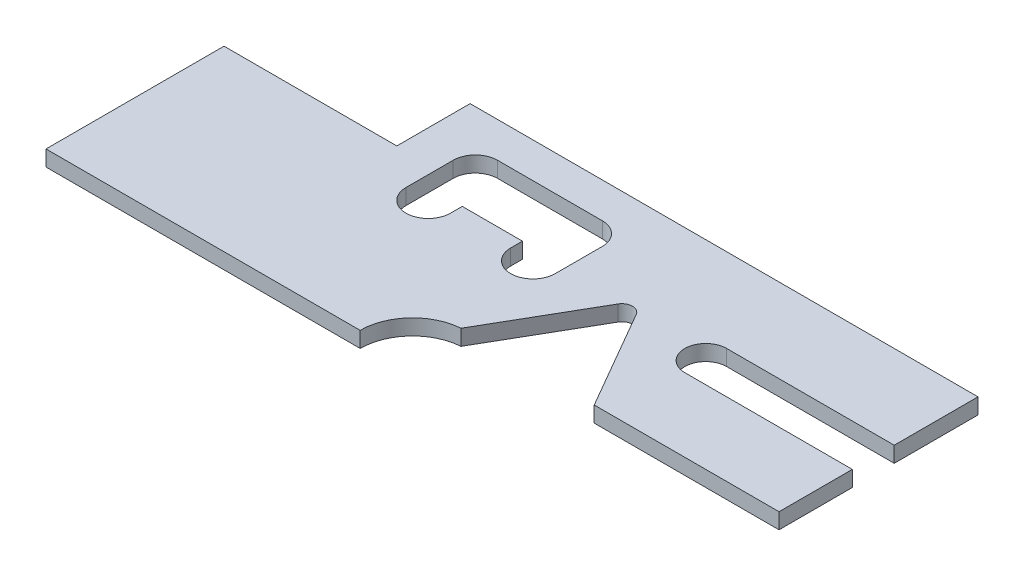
ISO-10303-21;
HEADER;
FILE_DESCRIPTION(('STEP AP214'),'2;1');
FILE_NAME('part.step','',(''),(''),'','','');
FILE_SCHEMA(('AUTOMOTIVE_DESIGN { 1 0 10303 214 1 1 1 1 }'));
ENDSEC;
DATA;
#1=APPLICATION_CONTEXT('core data for automotive mechanical design processes');
#2=APPLICATION_PROTOCOL_DEFINITION('international standard','automotive_design',2000,#1);
#3=PRODUCT_CONTEXT('',#1,'mechanical');
#4=PRODUCT('Part','Part','',(#3));
#5=PRODUCT_RELATED_PRODUCT_CATEGORY('part','',(#4));
#6=PRODUCT_DEFINITION_FORMATION('','',#4);
#7=PRODUCT_DEFINITION_CONTEXT('part definition',#1,'design');
#8=PRODUCT_DEFINITION('design','',#6,#7);
#9=PRODUCT_DEFINITION_SHAPE('','',#8);
#10=(LENGTH_UNIT() NAMED_UNIT(*) SI_UNIT(.MILLI.,.METRE.));
#11=(NAMED_UNIT(*) PLANE_ANGLE_UNIT() SI_UNIT($,.RADIAN.));
#12=(NAMED_UNIT(*) SI_UNIT($,.STERADIAN.) SOLID_ANGLE_UNIT());
#13=UNCERTAINTY_MEASURE_WITH_UNIT(LENGTH_MEASURE(1.E-05),#10,'distance_accuracy_value','');
#14=(GEOMETRIC_REPRESENTATION_CONTEXT(3) GLOBAL_UNCERTAINTY_ASSIGNED_CONTEXT((#13)) GLOBAL_UNIT_ASSIGNED_CONTEXT((#10,
#11,#12)) REPRESENTATION_CONTEXT('',''));
#15=CARTESIAN_POINT('',(0.,0.,0.));
#16=DIRECTION('',(0.,0.,1.));
#17=DIRECTION('',(1.,0.,0.));
#18=AXIS2_PLACEMENT_3D('',#15,#16,#17);
#19=CARTESIAN_POINT('',(98.,3.,-28.));
#20=DIRECTION('',(0.,1.,0.));
#21=DIRECTION('',(0.,0.,1.));
#22=AXIS2_PLACEMENT_3D('',#19,#20,#21);
#23=PLANE('',#22);
#24=DIRECTION('',(0.,0.,1.));
#25=VECTOR('',#24,1.);
#26=CARTESIAN_POINT('',(0.,3.,0.));
#27=LINE('',#26,#25);
#28=CARTESIAN_POINT('',(0.,3.,-34.));
#29=VERTEX_POINT('',#28);
#30=CARTESIAN_POINT('',(0.,3.,0.));
#31=VERTEX_POINT('',#30);
#32=EDGE_CURVE('E277',#29,#31,#27,.T.);
#33=ORIENTED_EDGE('',*,*,#32,.T.);
#34=DIRECTION('',(1.,0.,0.));
#35=VECTOR('',#34,1.);
#36=CARTESIAN_POINT('',(0.,3.,0.));
#37=LINE('',#36,#35);
#38=CARTESIAN_POINT('',(60.,3.,0.));
#39=VERTEX_POINT('',#38);
#40=EDGE_CURVE('E280',#31,#39,#37,.T.);
#41=ORIENTED_EDGE('',*,*,#40,.T.);
#42=CARTESIAN_POINT('',(70.,3.,0.));
#43=DIRECTION('',(0.,-1.,0.));
#44=DIRECTION('',(0.,0.,1.));
#45=AXIS2_PLACEMENT_3D('',#42,#43,#44);
#46=CIRCLE('',#45,10.);
#47=CARTESIAN_POINT('',(69.2834532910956,3.,-9.97429500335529));
#48=VERTEX_POINT('',#47);
#49=EDGE_CURVE('E283',#39,#48,#46,.T.);
#50=ORIENTED_EDGE('',*,*,#49,.T.);
#51=DIRECTION('',(0.500000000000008,0.,-0.866025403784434));
#52=VECTOR('',#51,1.);
#53=CARTESIAN_POINT('',(69.2834532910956,3.,-9.97429500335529));
#54=LINE('',#53,#52);
#55=CARTESIAN_POINT('',(80.2679491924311,3.,-29.));
#56=VERTEX_POINT('',#55);
#57=EDGE_CURVE('E285',#48,#56,#54,.T.);
#58=ORIENTED_EDGE('',*,*,#57,.T.);
#59=CARTESIAN_POINT('',(82.,3.,-28.));
#60=DIRECTION('',(0.,-1.,0.));
#61=DIRECTION('',(0.,0.,1.));
#62=AXIS2_PLACEMENT_3D('',#59,#60,#61);
#63=CIRCLE('',#62,2.);
#64=CARTESIAN_POINT('',(83.7320508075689,3.,-29.));
#65=VERTEX_POINT('',#64);
#66=EDGE_CURVE('E287',#56,#65,#63,.T.);
#67=ORIENTED_EDGE('',*,*,#66,.T.);
#68=DIRECTION('',(0.499999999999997,0.,0.866025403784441));
#69=VECTOR('',#68,1.);
#70=CARTESIAN_POINT('',(94.7017059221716,3.,-10.));
#71=LINE('',#70,#69);
#72=CARTESIAN_POINT('',(94.7017059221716,3.,-10.));
#73=VERTEX_POINT('',#72);
#74=EDGE_CURVE('E289',#65,#73,#71,.T.);
#75=ORIENTED_EDGE('',*,*,#74,.T.);
#76=DIRECTION('',(1.,0.,0.));
#77=VECTOR('',#76,1.);
#78=CARTESIAN_POINT('',(130.,3.,-10.));
#79=LINE('',#78,#77);
#80=CARTESIAN_POINT('',(130.,3.,-10.));
#81=VERTEX_POINT('',#80);
#82=EDGE_CURVE('E291',#73,#81,#79,.T.);
#83=ORIENTED_EDGE('',*,*,#82,.T.);
#84=DIRECTION('',(0.,0.,-1.));
#85=VECTOR('',#84,1.);
#86=CARTESIAN_POINT('',(130.,3.,-10.));
#87=LINE('',#86,#85);
#88=CARTESIAN_POINT('',(130.,3.,-24.));
#89=VERTEX_POINT('',#88);
#90=EDGE_CURVE('E293',#81,#89,#87,.T.);
#91=ORIENTED_EDGE('',*,*,#90,.T.);
#92=DIRECTION('',(-1.,0.,0.));
#93=VECTOR('',#92,1.);
#94=CARTESIAN_POINT('',(98.,3.,-24.));
#95=LINE('',#94,#93);
#96=CARTESIAN_POINT('',(98.,3.,-24.));
#97=VERTEX_POINT('',#96);
#98=EDGE_CURVE('E295',#89,#97,#95,.T.);
#99=ORIENTED_EDGE('',*,*,#98,.T.);
#100=CARTESIAN_POINT('',(98.,3.,-28.));
#101=DIRECTION('',(0.,-1.,0.));
#102=DIRECTION('',(0.,0.,1.));
#103=AXIS2_PLACEMENT_3D('',#100,#101,#102);
#104=CIRCLE('',#103,3.99999999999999);
#105=CARTESIAN_POINT('',(98.,3.,-32.));
#106=VERTEX_POINT('',#105);
#107=EDGE_CURVE('E297',#97,#106,#104,.T.);
#108=ORIENTED_EDGE('',*,*,#107,.T.);
#109=DIRECTION('',(1.,0.,0.));
#110=VECTOR('',#109,1.);
#111=CARTESIAN_POINT('',(98.,3.,-32.));
#112=LINE('',#111,#110);
#113=CARTESIAN_POINT('',(130.,3.,-32.));
#114=VERTEX_POINT('',#113);
#115=EDGE_CURVE('E299',#106,#114,#112,.T.);
#116=ORIENTED_EDGE('',*,*,#115,.T.);
#117=DIRECTION('',(0.,0.,-1.));
#118=VECTOR('',#117,1.);
#119=CARTESIAN_POINT('',(130.,3.,-32.));
#120=LINE('',#119,#118);
#121=CARTESIAN_POINT('',(130.,3.,-48.));
#122=VERTEX_POINT('',#121);
#123=EDGE_CURVE('E301',#114,#122,#120,.T.);
#124=ORIENTED_EDGE('',*,*,#123,.T.);
#125=DIRECTION('',(-1.,0.,0.));
#126=VECTOR('',#125,1.);
#127=CARTESIAN_POINT('',(33.,3.,-48.));
#128=LINE('',#127,#126);
#129=CARTESIAN_POINT('',(33.,3.,-48.));
#130=VERTEX_POINT('',#129);
#131=EDGE_CURVE('E303',#122,#130,#128,.T.);
#132=ORIENTED_EDGE('',*,*,#131,.T.);
#133=DIRECTION('',(0.,0.,1.));
#134=VECTOR('',#133,1.);
#135=CARTESIAN_POINT('',(33.,3.,-48.));
#136=LINE('',#135,#134);
#137=CARTESIAN_POINT('',(33.,3.,-34.));
#138=VERTEX_POINT('',#137);
#139=EDGE_CURVE('E305',#130,#138,#136,.T.);
#140=ORIENTED_EDGE('',*,*,#139,.T.);
#141=DIRECTION('',(-1.,0.,0.));
#142=VECTOR('',#141,1.);
#143=CARTESIAN_POINT('',(33.,3.,-34.));
#144=LINE('',#143,#142);
#145=EDGE_CURVE('E307',#138,#29,#144,.T.);
#146=ORIENTED_EDGE('',*,*,#145,.T.);
#147=EDGE_LOOP('',(#33,#41,#50,#58,#67,#75,#83,#91,#99,#108,#116,#124,#132,#140,#146));
#148=FACE_BOUND('',#147,.T.);
#149=DIRECTION('',(0.,0.,-1.));
#150=VECTOR('',#149,1.);
#151=CARTESIAN_POINT('',(69.25,3.,-28.));
#152=LINE('',#151,#150);
#153=CARTESIAN_POINT('',(69.25,3.,-28.));
#154=VERTEX_POINT('',#153);
#155=CARTESIAN_POINT('',(69.25,3.,-37.));
#156=VERTEX_POINT('',#155);
#157=EDGE_CURVE('E206',#154,#156,#152,.T.);
#158=ORIENTED_EDGE('',*,*,#157,.F.);
#159=CARTESIAN_POINT('',(65.,3.,-28.));
#160=DIRECTION('',(0.,1.,0.));
#161=DIRECTION('',(0.,0.,1.));
#162=AXIS2_PLACEMENT_3D('',#159,#160,#161);
#163=CIRCLE('',#162,4.24999999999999);
#164=CARTESIAN_POINT('',(60.75,3.,-28.));
#165=VERTEX_POINT('',#164);
#166=EDGE_CURVE('E198',#165,#154,#163,.T.);
#167=ORIENTED_EDGE('',*,*,#166,.F.);
#168=DIRECTION('',(0.,0.,1.));
#169=VECTOR('',#168,1.);
#170=CARTESIAN_POINT('',(60.75,3.,-28.));
#171=LINE('',#170,#169);
#172=CARTESIAN_POINT('',(60.75,3.,-30.25));
#173=VERTEX_POINT('',#172);
#174=EDGE_CURVE('E235',#173,#165,#171,.T.);
#175=ORIENTED_EDGE('',*,*,#174,.F.);
#176=DIRECTION('',(1.,0.,0.));
#177=VECTOR('',#176,1.);
#178=CARTESIAN_POINT('',(49.25,3.,-30.25));
#179=LINE('',#178,#177);
#180=CARTESIAN_POINT('',(49.25,3.,-30.25));
#181=VERTEX_POINT('',#180);
#182=EDGE_CURVE('E233',#181,#173,#179,.T.);
#183=ORIENTED_EDGE('',*,*,#182,.F.);
#184=DIRECTION('',(0.,0.,-1.));
#185=VECTOR('',#184,1.);
#186=CARTESIAN_POINT('',(49.25,3.,-28.));
#187=LINE('',#186,#185);
#188=CARTESIAN_POINT('',(49.25,3.,-28.));
#189=VERTEX_POINT('',#188);
#190=EDGE_CURVE('E231',#189,#181,#187,.T.);
#191=ORIENTED_EDGE('',*,*,#190,.F.);
#192=CARTESIAN_POINT('',(45.,3.,-28.));
#193=DIRECTION('',(0.,1.,0.));
#194=DIRECTION('',(0.,0.,1.));
#195=AXIS2_PLACEMENT_3D('',#192,#193,#194);
#196=CIRCLE('',#195,4.25);
#197=CARTESIAN_POINT('',(40.75,3.,-28.));
#198=VERTEX_POINT('',#197);
#199=EDGE_CURVE('E229',#198,#189,#196,.T.);
#200=ORIENTED_EDGE('',*,*,#199,.F.);
#201=DIRECTION('',(0.,0.,1.));
#202=VECTOR('',#201,1.);
#203=CARTESIAN_POINT('',(40.75,3.,-37.));
#204=LINE('',#203,#202);
#205=CARTESIAN_POINT('',(40.75,3.,-37.));
#206=VERTEX_POINT('',#205);
#207=EDGE_CURVE('E227',#206,#198,#204,.T.);
#208=ORIENTED_EDGE('',*,*,#207,.F.);
#209=CARTESIAN_POINT('',(45.,3.,-37.));
#210=DIRECTION('',(0.,1.,0.));
#211=DIRECTION('',(0.,0.,-1.));
#212=AXIS2_PLACEMENT_3D('',#209,#210,#211);
#213=CIRCLE('',#212,4.25);
#214=CARTESIAN_POINT('',(45.,3.,-41.25));
#215=VERTEX_POINT('',#214);
#216=EDGE_CURVE('E225',#215,#206,#213,.T.);
#217=ORIENTED_EDGE('',*,*,#216,.F.);
#218=DIRECTION('',(-1.,0.,0.));
#219=VECTOR('',#218,1.);
#220=CARTESIAN_POINT('',(65.,3.,-41.25));
#221=LINE('',#220,#219);
#222=CARTESIAN_POINT('',(65.,3.,-41.25));
#223=VERTEX_POINT('',#222);
#224=EDGE_CURVE('E221',#223,#215,#221,.T.);
#225=ORIENTED_EDGE('',*,*,#224,.F.);
#226=CARTESIAN_POINT('',(65.,3.,-37.));
#227=DIRECTION('',(0.,1.,0.));
#228=DIRECTION('',(0.,0.,1.));
#229=AXIS2_PLACEMENT_3D('',#226,#227,#228);
#230=CIRCLE('',#229,4.25000000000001);
#231=EDGE_CURVE('E219',#156,#223,#230,.T.);
#232=ORIENTED_EDGE('',*,*,#231,.F.);
#233=EDGE_LOOP('',(#158,#167,#175,#183,#191,#200,#208,#217,#225,#232));
#234=FACE_BOUND('',#233,.T.);
#235=ADVANCED_FACE('F31',(#148,#234),#23,.T.);
#236=CARTESIAN_POINT('',(98.,0.,-28.));
#237=DIRECTION('',(0.,1.,0.));
#238=DIRECTION('',(0.,0.,1.));
#239=AXIS2_PLACEMENT_3D('',#236,#237,#238);
#240=PLANE('',#239);
#241=DIRECTION('',(0.,0.,1.));
#242=VECTOR('',#241,1.);
#243=CARTESIAN_POINT('',(0.,0.,0.));
#244=LINE('',#243,#242);
#245=CARTESIAN_POINT('',(0.,0.,-34.));
#246=VERTEX_POINT('',#245);
#247=CARTESIAN_POINT('',(0.,0.,0.));
#248=VERTEX_POINT('',#247);
#249=EDGE_CURVE('E214',#246,#248,#244,.T.);
#250=ORIENTED_EDGE('',*,*,#249,.F.);
#251=DIRECTION('',(-1.,0.,0.));
#252=VECTOR('',#251,1.);
#253=CARTESIAN_POINT('',(33.,0.,-34.));
#254=LINE('',#253,#252);
#255=CARTESIAN_POINT('',(33.,0.,-34.));
#256=VERTEX_POINT('',#255);
#257=EDGE_CURVE('E281',#256,#246,#254,.T.);
#258=ORIENTED_EDGE('',*,*,#257,.F.);
#259=DIRECTION('',(0.,0.,1.));
#260=VECTOR('',#259,1.);
#261=CARTESIAN_POINT('',(33.,0.,-48.));
#262=LINE('',#261,#260);
#263=CARTESIAN_POINT('',(33.,0.,-48.));
#264=VERTEX_POINT('',#263);
#265=EDGE_CURVE('E336',#264,#256,#262,.T.);
#266=ORIENTED_EDGE('',*,*,#265,.F.);
#267=DIRECTION('',(-1.,0.,0.));
#268=VECTOR('',#267,1.);
#269=CARTESIAN_POINT('',(33.,0.,-48.));
#270=LINE('',#269,#268);
#271=CARTESIAN_POINT('',(130.,0.,-48.));
#272=VERTEX_POINT('',#271);
#273=EDGE_CURVE('E334',#272,#264,#270,.T.);
#274=ORIENTED_EDGE('',*,*,#273,.F.);
#275=DIRECTION('',(0.,0.,-1.));
#276=VECTOR('',#275,1.);
#277=CARTESIAN_POINT('',(130.,0.,-32.));
#278=LINE('',#277,#276);
#279=CARTESIAN_POINT('',(130.,0.,-32.));
#280=VERTEX_POINT('',#279);
#281=EDGE_CURVE('E332',#280,#272,#278,.T.);
#282=ORIENTED_EDGE('',*,*,#281,.F.);
#283=DIRECTION('',(1.,0.,0.));
#284=VECTOR('',#283,1.);
#285=CARTESIAN_POINT('',(98.,0.,-32.));
#286=LINE('',#285,#284);
#287=CARTESIAN_POINT('',(98.,0.,-32.));
#288=VERTEX_POINT('',#287);
#289=EDGE_CURVE('E330',#288,#280,#286,.T.);
#290=ORIENTED_EDGE('',*,*,#289,.F.);
#291=CARTESIAN_POINT('',(98.,0.,-28.));
#292=DIRECTION('',(0.,-1.,0.));
#293=DIRECTION('',(0.,0.,1.));
#294=AXIS2_PLACEMENT_3D('',#291,#292,#293);
#295=CIRCLE('',#294,3.99999999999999);
#296=CARTESIAN_POINT('',(98.,0.,-24.));
#297=VERTEX_POINT('',#296);
#298=EDGE_CURVE('E328',#297,#288,#295,.T.);
#299=ORIENTED_EDGE('',*,*,#298,.F.);
#300=DIRECTION('',(-1.,0.,0.));
#301=VECTOR('',#300,1.);
#302=CARTESIAN_POINT('',(98.,0.,-24.));
#303=LINE('',#302,#301);
#304=CARTESIAN_POINT('',(130.,0.,-24.));
#305=VERTEX_POINT('',#304);
#306=EDGE_CURVE('E326',#305,#297,#303,.T.);
#307=ORIENTED_EDGE('',*,*,#306,.F.);
#308=DIRECTION('',(0.,0.,-1.));
#309=VECTOR('',#308,1.);
#310=CARTESIAN_POINT('',(130.,0.,-10.));
#311=LINE('',#310,#309);
#312=CARTESIAN_POINT('',(130.,0.,-10.));
#313=VERTEX_POINT('',#312);
#314=EDGE_CURVE('E324',#313,#305,#311,.T.);
#315=ORIENTED_EDGE('',*,*,#314,.F.);
#316=DIRECTION('',(1.,0.,0.));
#317=VECTOR('',#316,1.);
#318=CARTESIAN_POINT('',(130.,0.,-10.));
#319=LINE('',#318,#317);
#320=CARTESIAN_POINT('',(94.7017059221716,0.,-10.));
#321=VERTEX_POINT('',#320);
#322=EDGE_CURVE('E322',#321,#313,#319,.T.);
#323=ORIENTED_EDGE('',*,*,#322,.F.);
#324=DIRECTION('',(0.499999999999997,0.,0.866025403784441));
#325=VECTOR('',#324,1.);
#326=CARTESIAN_POINT('',(94.7017059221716,0.,-10.));
#327=LINE('',#326,#325);
#328=CARTESIAN_POINT('',(83.7320508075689,0.,-29.));
#329=VERTEX_POINT('',#328);
#330=EDGE_CURVE('E320',#329,#321,#327,.T.);
#331=ORIENTED_EDGE('',*,*,#330,.F.);
#332=CARTESIAN_POINT('',(82.,0.,-28.));
#333=DIRECTION('',(0.,-1.,0.));
#334=DIRECTION('',(0.,0.,1.));
#335=AXIS2_PLACEMENT_3D('',#332,#333,#334);
#336=CIRCLE('',#335,2.);
#337=CARTESIAN_POINT('',(80.2679491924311,0.,-29.));
#338=VERTEX_POINT('',#337);
#339=EDGE_CURVE('E318',#338,#329,#336,.T.);
#340=ORIENTED_EDGE('',*,*,#339,.F.);
#341=DIRECTION('',(0.500000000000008,0.,-0.866025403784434));
#342=VECTOR('',#341,1.);
#343=CARTESIAN_POINT('',(69.2834532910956,0.,-9.97429500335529));
#344=LINE('',#343,#342);
#345=CARTESIAN_POINT('',(69.2834532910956,0.,-9.97429500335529));
#346=VERTEX_POINT('',#345);
#347=EDGE_CURVE('E316',#346,#338,#344,.T.);
#348=ORIENTED_EDGE('',*,*,#347,.F.);
#349=CARTESIAN_POINT('',(70.,0.,0.));
#350=DIRECTION('',(0.,-1.,0.));
#351=DIRECTION('',(0.,0.,1.));
#352=AXIS2_PLACEMENT_3D('',#349,#350,#351);
#353=CIRCLE('',#352,10.);
#354=CARTESIAN_POINT('',(60.,0.,0.));
#355=VERTEX_POINT('',#354);
#356=EDGE_CURVE('E314',#355,#346,#353,.T.);
#357=ORIENTED_EDGE('',*,*,#356,.F.);
#358=DIRECTION('',(1.,0.,0.));
#359=VECTOR('',#358,1.);
#360=CARTESIAN_POINT('',(0.,0.,0.));
#361=LINE('',#360,#359);
#362=EDGE_CURVE('E312',#248,#355,#361,.T.);
#363=ORIENTED_EDGE('',*,*,#362,.F.);
#364=EDGE_LOOP('',(#250,#258,#266,#274,#282,#290,#299,#307,#315,#323,#331,#340,#348,#357,#363));
#365=FACE_BOUND('',#364,.T.);
#366=CARTESIAN_POINT('',(65.,0.,-28.));
#367=DIRECTION('',(0.,1.,0.));
#368=DIRECTION('',(0.,0.,1.));
#369=AXIS2_PLACEMENT_3D('',#366,#367,#368);
#370=CIRCLE('',#369,4.24999999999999);
#371=CARTESIAN_POINT('',(60.75,0.,-28.));
#372=VERTEX_POINT('',#371);
#373=CARTESIAN_POINT('',(69.25,0.,-28.));
#374=VERTEX_POINT('',#373);
#375=EDGE_CURVE('E54',#372,#374,#370,.T.);
#376=ORIENTED_EDGE('',*,*,#375,.T.);
#377=DIRECTION('',(0.,0.,-1.));
#378=VECTOR('',#377,1.);
#379=CARTESIAN_POINT('',(69.25,0.,-28.));
#380=LINE('',#379,#378);
#381=CARTESIAN_POINT('',(69.25,0.,-37.));
#382=VERTEX_POINT('',#381);
#383=EDGE_CURVE('E213',#374,#382,#380,.T.);
#384=ORIENTED_EDGE('',*,*,#383,.T.);
#385=CARTESIAN_POINT('',(65.,0.,-37.));
#386=DIRECTION('',(0.,1.,0.));
#387=DIRECTION('',(0.,0.,1.));
#388=AXIS2_PLACEMENT_3D('',#385,#386,#387);
#389=CIRCLE('',#388,4.25000000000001);
#390=CARTESIAN_POINT('',(65.,0.,-41.25));
#391=VERTEX_POINT('',#390);
#392=EDGE_CURVE('E239',#382,#391,#389,.T.);
#393=ORIENTED_EDGE('',*,*,#392,.T.);
#394=DIRECTION('',(-1.,0.,0.));
#395=VECTOR('',#394,1.);
#396=CARTESIAN_POINT('',(65.,0.,-41.25));
#397=LINE('',#396,#395);
#398=CARTESIAN_POINT('',(45.,0.,-41.25));
#399=VERTEX_POINT('',#398);
#400=EDGE_CURVE('E242',#391,#399,#397,.T.);
#401=ORIENTED_EDGE('',*,*,#400,.T.);
#402=CARTESIAN_POINT('',(45.,0.,-37.));
#403=DIRECTION('',(0.,1.,0.));
#404=DIRECTION('',(0.,0.,-1.));
#405=AXIS2_PLACEMENT_3D('',#402,#403,#404);
#406=CIRCLE('',#405,4.25);
#407=CARTESIAN_POINT('',(40.75,0.,-37.));
#408=VERTEX_POINT('',#407);
#409=EDGE_CURVE('E245',#399,#408,#406,.T.);
#410=ORIENTED_EDGE('',*,*,#409,.T.);
#411=DIRECTION('',(0.,0.,1.));
#412=VECTOR('',#411,1.);
#413=CARTESIAN_POINT('',(40.75,0.,-37.));
#414=LINE('',#413,#412);
#415=CARTESIAN_POINT('',(40.75,0.,-28.));
#416=VERTEX_POINT('',#415);
#417=EDGE_CURVE('E248',#408,#416,#414,.T.);
#418=ORIENTED_EDGE('',*,*,#417,.T.);
#419=CARTESIAN_POINT('',(45.,0.,-28.));
#420=DIRECTION('',(0.,1.,0.));
#421=DIRECTION('',(0.,0.,1.));
#422=AXIS2_PLACEMENT_3D('',#419,#420,#421);
#423=CIRCLE('',#422,4.25);
#424=CARTESIAN_POINT('',(49.25,0.,-28.));
#425=VERTEX_POINT('',#424);
#426=EDGE_CURVE('E251',#416,#425,#423,.T.);
#427=ORIENTED_EDGE('',*,*,#426,.T.);
#428=DIRECTION('',(0.,0.,-1.));
#429=VECTOR('',#428,1.);
#430=CARTESIAN_POINT('',(49.25,0.,-28.));
#431=LINE('',#430,#429);
#432=CARTESIAN_POINT('',(49.25,0.,-30.25));
#433=VERTEX_POINT('',#432);
#434=EDGE_CURVE('E254',#425,#433,#431,.T.);
#435=ORIENTED_EDGE('',*,*,#434,.T.);
#436=DIRECTION('',(1.,0.,0.));
#437=VECTOR('',#436,1.);
#438=CARTESIAN_POINT('',(49.25,0.,-30.25));
#439=LINE('',#438,#437);
#440=CARTESIAN_POINT('',(60.75,0.,-30.25));
#441=VERTEX_POINT('',#440);
#442=EDGE_CURVE('E257',#433,#441,#439,.T.);
#443=ORIENTED_EDGE('',*,*,#442,.T.);
#444=DIRECTION('',(0.,0.,1.));
#445=VECTOR('',#444,1.);
#446=CARTESIAN_POINT('',(60.75,0.,-28.));
#447=LINE('',#446,#445);
#448=EDGE_CURVE('E207',#441,#372,#447,.T.);
#449=ORIENTED_EDGE('',*,*,#448,.T.);
#450=EDGE_LOOP('',(#376,#384,#393,#401,#410,#418,#427,#435,#443,#449));
#451=FACE_BOUND('',#450,.T.);
#452=ADVANCED_FACE('F387',(#365,#451),#240,.F.);
#453=CARTESIAN_POINT('',(0.,3.,0.));
#454=DIRECTION('',(1.,0.,0.));
#455=DIRECTION('',(0.,0.,-1.));
#456=AXIS2_PLACEMENT_3D('',#453,#454,#455);
#457=PLANE('',#456);
#458=ORIENTED_EDGE('',*,*,#249,.T.);
#459=DIRECTION('',(0.,-1.,0.));
#460=VECTOR('',#459,1.);
#461=CARTESIAN_POINT('',(0.,3.,0.));
#462=LINE('',#461,#460);
#463=EDGE_CURVE('E11',#31,#248,#462,.T.);
#464=ORIENTED_EDGE('',*,*,#463,.F.);
#465=ORIENTED_EDGE('',*,*,#32,.F.);
#466=DIRECTION('',(0.,-1.,0.));
#467=VECTOR('',#466,1.);
#468=CARTESIAN_POINT('',(0.,3.,-34.));
#469=LINE('',#468,#467);
#470=EDGE_CURVE('E309',#29,#246,#469,.T.);
#471=ORIENTED_EDGE('',*,*,#470,.T.);
#472=EDGE_LOOP('',(#458,#464,#465,#471));
#473=FACE_BOUND('',#472,.T.);
#474=ADVANCED_FACE('F33',(#473),#457,.F.);
#475=CARTESIAN_POINT('',(0.,3.,0.));
#476=DIRECTION('',(0.,0.,-1.));
#477=DIRECTION('',(-1.,0.,0.));
#478=AXIS2_PLACEMENT_3D('',#475,#476,#477);
#479=PLANE('',#478);
#480=ORIENTED_EDGE('',*,*,#362,.T.);
#481=DIRECTION('',(0.,-1.,0.));
#482=VECTOR('',#481,1.);
#483=CARTESIAN_POINT('',(60.,3.,0.));
#484=LINE('',#483,#482);
#485=EDGE_CURVE('E39',#39,#355,#484,.T.);
#486=ORIENTED_EDGE('',*,*,#485,.F.);
#487=ORIENTED_EDGE('',*,*,#40,.F.);
#488=ORIENTED_EDGE('',*,*,#463,.T.);
#489=EDGE_LOOP('',(#480,#486,#487,#488));
#490=FACE_BOUND('',#489,.T.);
#491=ADVANCED_FACE('F404',(#490),#479,.F.);
#492=CARTESIAN_POINT('',(70.,3.,0.));
#493=DIRECTION('',(0.,-1.,0.));
#494=DIRECTION('',(0.,0.,-1.));
#495=AXIS2_PLACEMENT_3D('',#492,#493,#494);
#496=CYLINDRICAL_SURFACE('',#495,10.);
#497=ORIENTED_EDGE('',*,*,#356,.T.);
#498=DIRECTION('',(0.,-1.,0.));
#499=VECTOR('',#498,1.);
#500=CARTESIAN_POINT('',(69.2834532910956,3.,-9.97429500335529));
#501=LINE('',#500,#499);
#502=EDGE_CURVE('E374',#48,#346,#501,.T.);
#503=ORIENTED_EDGE('',*,*,#502,.F.);
#504=ORIENTED_EDGE('',*,*,#49,.F.);
#505=ORIENTED_EDGE('',*,*,#485,.T.);
#506=EDGE_LOOP('',(#497,#503,#504,#505));
#507=FACE_BOUND('',#506,.T.);
#508=ADVANCED_FACE('F381',(#507),#496,.F.);
#509=CARTESIAN_POINT('',(69.2834532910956,3.,-9.97429500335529));
#510=DIRECTION('',(-0.866025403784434,0.,-0.500000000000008));
#511=DIRECTION('',(-0.500000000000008,0.,0.866025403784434));
#512=AXIS2_PLACEMENT_3D('',#509,#510,#511);
#513=PLANE('',#512);
#514=ORIENTED_EDGE('',*,*,#347,.T.);
#515=DIRECTION('',(0.,-1.,0.));
#516=VECTOR('',#515,1.);
#517=CARTESIAN_POINT('',(80.2679491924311,3.,-29.));
#518=LINE('',#517,#516);
#519=EDGE_CURVE('E371',#56,#338,#518,.T.);
#520=ORIENTED_EDGE('',*,*,#519,.F.);
#521=ORIENTED_EDGE('',*,*,#57,.F.);
#522=ORIENTED_EDGE('',*,*,#502,.T.);
#523=EDGE_LOOP('',(#514,#520,#521,#522));
#524=FACE_BOUND('',#523,.T.);
#525=ADVANCED_FACE('F393',(#524),#513,.F.);
#526=CARTESIAN_POINT('',(82.,3.,-28.));
#527=DIRECTION('',(0.,-1.,0.));
#528=DIRECTION('',(0.,0.,-1.));
#529=AXIS2_PLACEMENT_3D('',#526,#527,#528);
#530=CYLINDRICAL_SURFACE('',#529,2.);
#531=ORIENTED_EDGE('',*,*,#339,.T.);
#532=DIRECTION('',(0.,-1.,0.));
#533=VECTOR('',#532,1.);
#534=CARTESIAN_POINT('',(83.7320508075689,3.,-29.));
#535=LINE('',#534,#533);
#536=EDGE_CURVE('E368',#65,#329,#535,.T.);
#537=ORIENTED_EDGE('',*,*,#536,.F.);
#538=ORIENTED_EDGE('',*,*,#66,.F.);
#539=ORIENTED_EDGE('',*,*,#519,.T.);
#540=EDGE_LOOP('',(#531,#537,#538,#539));
#541=FACE_BOUND('',#540,.T.);
#542=ADVANCED_FACE('F397',(#541),#530,.F.);
#543=CARTESIAN_POINT('',(94.7017059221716,3.,-10.));
#544=DIRECTION('',(0.866025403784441,0.,-0.499999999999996));
#545=DIRECTION('',(-0.499999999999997,0.,-0.866025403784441));
#546=AXIS2_PLACEMENT_3D('',#543,#544,#545);
#547=PLANE('',#546);
#548=ORIENTED_EDGE('',*,*,#330,.T.);
#549=DIRECTION('',(0.,-1.,0.));
#550=VECTOR('',#549,1.);
#551=CARTESIAN_POINT('',(94.7017059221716,3.,-10.));
#552=LINE('',#551,#550);
#553=EDGE_CURVE('E365',#73,#321,#552,.T.);
#554=ORIENTED_EDGE('',*,*,#553,.F.);
#555=ORIENTED_EDGE('',*,*,#74,.F.);
#556=ORIENTED_EDGE('',*,*,#536,.T.);
#557=EDGE_LOOP('',(#548,#554,#555,#556));
#558=FACE_BOUND('',#557,.T.);
#559=ADVANCED_FACE('F452',(#558),#547,.F.);
#560=CARTESIAN_POINT('',(130.,3.,-10.));
#561=DIRECTION('',(0.,0.,-1.));
#562=DIRECTION('',(-1.,0.,0.));
#563=AXIS2_PLACEMENT_3D('',#560,#561,#562);
#564=PLANE('',#563);
#565=ORIENTED_EDGE('',*,*,#322,.T.);
#566=DIRECTION('',(0.,-1.,0.));
#567=VECTOR('',#566,1.);
#568=CARTESIAN_POINT('',(130.,3.,-10.));
#569=LINE('',#568,#567);
#570=EDGE_CURVE('E362',#81,#313,#569,.T.);
#571=ORIENTED_EDGE('',*,*,#570,.F.);
#572=ORIENTED_EDGE('',*,*,#82,.F.);
#573=ORIENTED_EDGE('',*,*,#553,.T.);
#574=EDGE_LOOP('',(#565,#571,#572,#573));
#575=FACE_BOUND('',#574,.T.);
#576=ADVANCED_FACE('F450',(#575),#564,.F.);
#577=CARTESIAN_POINT('',(130.,3.,-10.));
#578=DIRECTION('',(-1.,0.,0.));
#579=DIRECTION('',(0.,0.,1.));
#580=AXIS2_PLACEMENT_3D('',#577,#578,#579);
#581=PLANE('',#580);
#582=ORIENTED_EDGE('',*,*,#314,.T.);
#583=DIRECTION('',(0.,-1.,0.));
#584=VECTOR('',#583,1.);
#585=CARTESIAN_POINT('',(130.,3.,-24.));
#586=LINE('',#585,#584);
#587=EDGE_CURVE('E359',#89,#305,#586,.T.);
#588=ORIENTED_EDGE('',*,*,#587,.F.);
#589=ORIENTED_EDGE('',*,*,#90,.F.);
#590=ORIENTED_EDGE('',*,*,#570,.T.);
#591=EDGE_LOOP('',(#582,#588,#589,#590));
#592=FACE_BOUND('',#591,.T.);
#593=ADVANCED_FACE('F446',(#592),#581,.F.);
#594=CARTESIAN_POINT('',(98.,3.,-24.));
#595=DIRECTION('',(0.,0.,1.));
#596=DIRECTION('',(1.,0.,0.));
#597=AXIS2_PLACEMENT_3D('',#594,#595,#596);
#598=PLANE('',#597);
#599=ORIENTED_EDGE('',*,*,#306,.T.);
#600=DIRECTION('',(0.,-1.,0.));
#601=VECTOR('',#600,1.);
#602=CARTESIAN_POINT('',(98.,3.,-24.));
#603=LINE('',#602,#601);
#604=EDGE_CURVE('E356',#97,#297,#603,.T.);
#605=ORIENTED_EDGE('',*,*,#604,.F.);
#606=ORIENTED_EDGE('',*,*,#98,.F.);
#607=ORIENTED_EDGE('',*,*,#587,.T.);
#608=EDGE_LOOP('',(#599,#605,#606,#607));
#609=FACE_BOUND('',#608,.T.);
#610=ADVANCED_FACE('F441',(#609),#598,.F.);
#611=CARTESIAN_POINT('',(98.,3.,-28.));
#612=DIRECTION('',(0.,-1.,0.));
#613=DIRECTION('',(0.,0.,-1.));
#614=AXIS2_PLACEMENT_3D('',#611,#612,#613);
#615=CYLINDRICAL_SURFACE('',#614,3.99999999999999);
#616=ORIENTED_EDGE('',*,*,#298,.T.);
#617=DIRECTION('',(0.,-1.,0.));
#618=VECTOR('',#617,1.);
#619=CARTESIAN_POINT('',(98.,3.,-32.));
#620=LINE('',#619,#618);
#621=EDGE_CURVE('E353',#106,#288,#620,.T.);
#622=ORIENTED_EDGE('',*,*,#621,.F.);
#623=ORIENTED_EDGE('',*,*,#107,.F.);
#624=ORIENTED_EDGE('',*,*,#604,.T.);
#625=EDGE_LOOP('',(#616,#622,#623,#624));
#626=FACE_BOUND('',#625,.T.);
#627=ADVANCED_FACE('F435',(#626),#615,.F.);
#628=CARTESIAN_POINT('',(98.,3.,-32.));
#629=DIRECTION('',(0.,0.,-1.));
#630=DIRECTION('',(-1.,0.,0.));
#631=AXIS2_PLACEMENT_3D('',#628,#629,#630);
#632=PLANE('',#631);
#633=ORIENTED_EDGE('',*,*,#289,.T.);
#634=DIRECTION('',(0.,-1.,0.));
#635=VECTOR('',#634,1.);
#636=CARTESIAN_POINT('',(130.,3.,-32.));
#637=LINE('',#636,#635);
#638=EDGE_CURVE('E350',#114,#280,#637,.T.);
#639=ORIENTED_EDGE('',*,*,#638,.F.);
#640=ORIENTED_EDGE('',*,*,#115,.F.);
#641=ORIENTED_EDGE('',*,*,#621,.T.);
#642=EDGE_LOOP('',(#633,#639,#640,#641));
#643=FACE_BOUND('',#642,.T.);
#644=ADVANCED_FACE('F431',(#643),#632,.F.);
#645=CARTESIAN_POINT('',(130.,3.,-32.));
#646=DIRECTION('',(-1.,0.,0.));
#647=DIRECTION('',(0.,0.,1.));
#648=AXIS2_PLACEMENT_3D('',#645,#646,#647);
#649=PLANE('',#648);
#650=ORIENTED_EDGE('',*,*,#281,.T.);
#651=DIRECTION('',(0.,-1.,0.));
#652=VECTOR('',#651,1.);
#653=CARTESIAN_POINT('',(130.,3.,-48.));
#654=LINE('',#653,#652);
#655=EDGE_CURVE('E347',#122,#272,#654,.T.);
#656=ORIENTED_EDGE('',*,*,#655,.F.);
#657=ORIENTED_EDGE('',*,*,#123,.F.);
#658=ORIENTED_EDGE('',*,*,#638,.T.);
#659=EDGE_LOOP('',(#650,#656,#657,#658));
#660=FACE_BOUND('',#659,.T.);
#661=ADVANCED_FACE('F426',(#660),#649,.F.);
#662=CARTESIAN_POINT('',(33.,3.,-48.));
#663=DIRECTION('',(0.,0.,1.));
#664=DIRECTION('',(1.,0.,0.));
#665=AXIS2_PLACEMENT_3D('',#662,#663,#664);
#666=PLANE('',#665);
#667=ORIENTED_EDGE('',*,*,#273,.T.);
#668=DIRECTION('',(0.,-1.,0.));
#669=VECTOR('',#668,1.);
#670=CARTESIAN_POINT('',(33.,3.,-48.));
#671=LINE('',#670,#669);
#672=EDGE_CURVE('E344',#130,#264,#671,.T.);
#673=ORIENTED_EDGE('',*,*,#672,.F.);
#674=ORIENTED_EDGE('',*,*,#131,.F.);
#675=ORIENTED_EDGE('',*,*,#655,.T.);
#676=EDGE_LOOP('',(#667,#673,#674,#675));
#677=FACE_BOUND('',#676,.T.);
#678=ADVANCED_FACE('F420',(#677),#666,.F.);
#679=CARTESIAN_POINT('',(33.,3.,-48.));
#680=DIRECTION('',(1.,0.,0.));
#681=DIRECTION('',(0.,0.,-1.));
#682=AXIS2_PLACEMENT_3D('',#679,#680,#681);
#683=PLANE('',#682);
#684=ORIENTED_EDGE('',*,*,#265,.T.);
#685=DIRECTION('',(0.,-1.,0.));
#686=VECTOR('',#685,1.);
#687=CARTESIAN_POINT('',(33.,3.,-34.));
#688=LINE('',#687,#686);
#689=EDGE_CURVE('E341',#138,#256,#688,.T.);
#690=ORIENTED_EDGE('',*,*,#689,.F.);
#691=ORIENTED_EDGE('',*,*,#139,.F.);
#692=ORIENTED_EDGE('',*,*,#672,.T.);
#693=EDGE_LOOP('',(#684,#690,#691,#692));
#694=FACE_BOUND('',#693,.T.);
#695=ADVANCED_FACE('F416',(#694),#683,.F.);
#696=CARTESIAN_POINT('',(33.,3.,-34.));
#697=DIRECTION('',(0.,0.,1.));
#698=DIRECTION('',(1.,0.,0.));
#699=AXIS2_PLACEMENT_3D('',#696,#697,#698);
#700=PLANE('',#699);
#701=ORIENTED_EDGE('',*,*,#257,.T.);
#702=ORIENTED_EDGE('',*,*,#470,.F.);
#703=ORIENTED_EDGE('',*,*,#145,.F.);
#704=ORIENTED_EDGE('',*,*,#689,.T.);
#705=EDGE_LOOP('',(#701,#702,#703,#704));
#706=FACE_BOUND('',#705,.T.);
#707=ADVANCED_FACE('F411',(#706),#700,.F.);
#708=CARTESIAN_POINT('',(65.,3.,-28.));
#709=DIRECTION('',(0.,-1.,0.));
#710=DIRECTION('',(0.,0.,-1.));
#711=AXIS2_PLACEMENT_3D('',#708,#709,#710);
#712=CYLINDRICAL_SURFACE('',#711,4.24999999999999);
#713=ORIENTED_EDGE('',*,*,#375,.F.);
#714=DIRECTION('',(0.,-1.,0.));
#715=VECTOR('',#714,1.);
#716=CARTESIAN_POINT('',(60.75,3.,-28.));
#717=LINE('',#716,#715);
#718=EDGE_CURVE('E202',#165,#372,#717,.T.);
#719=ORIENTED_EDGE('',*,*,#718,.F.);
#720=ORIENTED_EDGE('',*,*,#166,.T.);
#721=DIRECTION('',(0.,-1.,0.));
#722=VECTOR('',#721,1.);
#723=CARTESIAN_POINT('',(69.25,3.,-28.));
#724=LINE('',#723,#722);
#725=EDGE_CURVE('E201',#154,#374,#724,.T.);
#726=ORIENTED_EDGE('',*,*,#725,.T.);
#727=EDGE_LOOP('',(#713,#719,#720,#726));
#728=FACE_BOUND('',#727,.T.);
#729=ADVANCED_FACE('F200',(#728),#712,.F.);
#730=CARTESIAN_POINT('',(69.25,3.,-28.));
#731=DIRECTION('',(-1.,0.,0.));
#732=DIRECTION('',(0.,0.,1.));
#733=AXIS2_PLACEMENT_3D('',#730,#731,#732);
#734=PLANE('',#733);
#735=ORIENTED_EDGE('',*,*,#383,.F.);
#736=ORIENTED_EDGE('',*,*,#725,.F.);
#737=ORIENTED_EDGE('',*,*,#157,.T.);
#738=DIRECTION('',(0.,-1.,0.));
#739=VECTOR('',#738,1.);
#740=CARTESIAN_POINT('',(69.25,3.,-37.));
#741=LINE('',#740,#739);
#742=EDGE_CURVE('E215',#156,#382,#741,.T.);
#743=ORIENTED_EDGE('',*,*,#742,.T.);
#744=EDGE_LOOP('',(#735,#736,#737,#743));
#745=FACE_BOUND('',#744,.T.);
#746=ADVANCED_FACE('F210',(#745),#734,.T.);
#747=CARTESIAN_POINT('',(65.,3.,-37.));
#748=DIRECTION('',(0.,-1.,0.));
#749=DIRECTION('',(0.,0.,-1.));
#750=AXIS2_PLACEMENT_3D('',#747,#748,#749);
#751=CYLINDRICAL_SURFACE('',#750,4.25000000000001);
#752=ORIENTED_EDGE('',*,*,#392,.F.);
#753=ORIENTED_EDGE('',*,*,#742,.F.);
#754=ORIENTED_EDGE('',*,*,#231,.T.);
#755=DIRECTION('',(0.,-1.,0.));
#756=VECTOR('',#755,1.);
#757=CARTESIAN_POINT('',(65.,3.,-41.25));
#758=LINE('',#757,#756);
#759=EDGE_CURVE('E274',#223,#391,#758,.T.);
#760=ORIENTED_EDGE('',*,*,#759,.T.);
#761=EDGE_LOOP('',(#752,#753,#754,#760));
#762=FACE_BOUND('',#761,.T.);
#763=ADVANCED_FACE('F528',(#762),#751,.F.);
#764=CARTESIAN_POINT('',(65.,3.,-41.25));
#765=DIRECTION('',(0.,0.,1.));
#766=DIRECTION('',(1.,0.,0.));
#767=AXIS2_PLACEMENT_3D('',#764,#765,#766);
#768=PLANE('',#767);
#769=ORIENTED_EDGE('',*,*,#400,.F.);
#770=ORIENTED_EDGE('',*,*,#759,.F.);
#771=ORIENTED_EDGE('',*,*,#224,.T.);
#772=DIRECTION('',(0.,-1.,0.));
#773=VECTOR('',#772,1.);
#774=CARTESIAN_POINT('',(45.,3.,-41.25));
#775=LINE('',#774,#773);
#776=EDGE_CURVE('E272',#215,#399,#775,.T.);
#777=ORIENTED_EDGE('',*,*,#776,.T.);
#778=EDGE_LOOP('',(#769,#770,#771,#777));
#779=FACE_BOUND('',#778,.T.);
#780=ADVANCED_FACE('F534',(#779),#768,.T.);
#781=CARTESIAN_POINT('',(45.,3.,-37.));
#782=DIRECTION('',(0.,-1.,0.));
#783=DIRECTION('',(0.,0.,-1.));
#784=AXIS2_PLACEMENT_3D('',#781,#782,#783);
#785=CYLINDRICAL_SURFACE('',#784,4.25);
#786=ORIENTED_EDGE('',*,*,#409,.F.);
#787=ORIENTED_EDGE('',*,*,#776,.F.);
#788=ORIENTED_EDGE('',*,*,#216,.T.);
#789=DIRECTION('',(0.,-1.,0.));
#790=VECTOR('',#789,1.);
#791=CARTESIAN_POINT('',(40.75,3.,-37.));
#792=LINE('',#791,#790);
#793=EDGE_CURVE('E270',#206,#408,#792,.T.);
#794=ORIENTED_EDGE('',*,*,#793,.T.);
#795=EDGE_LOOP('',(#786,#787,#788,#794));
#796=FACE_BOUND('',#795,.T.);
#797=ADVANCED_FACE('F542',(#796),#785,.F.);
#798=CARTESIAN_POINT('',(40.75,3.,-37.));
#799=DIRECTION('',(1.,0.,0.));
#800=DIRECTION('',(0.,0.,-1.));
#801=AXIS2_PLACEMENT_3D('',#798,#799,#800);
#802=PLANE('',#801);
#803=ORIENTED_EDGE('',*,*,#417,.F.);
#804=ORIENTED_EDGE('',*,*,#793,.F.);
#805=ORIENTED_EDGE('',*,*,#207,.T.);
#806=DIRECTION('',(0.,-1.,0.));
#807=VECTOR('',#806,1.);
#808=CARTESIAN_POINT('',(40.75,3.,-28.));
#809=LINE('',#808,#807);
#810=EDGE_CURVE('E268',#198,#416,#809,.T.);
#811=ORIENTED_EDGE('',*,*,#810,.T.);
#812=EDGE_LOOP('',(#803,#804,#805,#811));
#813=FACE_BOUND('',#812,.T.);
#814=ADVANCED_FACE('F550',(#813),#802,.T.);
#815=CARTESIAN_POINT('',(45.,3.,-28.));
#816=DIRECTION('',(0.,-1.,0.));
#817=DIRECTION('',(0.,0.,-1.));
#818=AXIS2_PLACEMENT_3D('',#815,#816,#817);
#819=CYLINDRICAL_SURFACE('',#818,4.25);
#820=ORIENTED_EDGE('',*,*,#426,.F.);
#821=ORIENTED_EDGE('',*,*,#810,.F.);
#822=ORIENTED_EDGE('',*,*,#199,.T.);
#823=DIRECTION('',(0.,-1.,0.));
#824=VECTOR('',#823,1.);
#825=CARTESIAN_POINT('',(49.25,3.,-28.));
#826=LINE('',#825,#824);
#827=EDGE_CURVE('E266',#189,#425,#826,.T.);
#828=ORIENTED_EDGE('',*,*,#827,.T.);
#829=EDGE_LOOP('',(#820,#821,#822,#828));
#830=FACE_BOUND('',#829,.T.);
#831=ADVANCED_FACE('F558',(#830),#819,.F.);
#832=CARTESIAN_POINT('',(49.25,3.,-28.));
#833=DIRECTION('',(-1.,0.,0.));
#834=DIRECTION('',(0.,0.,1.));
#835=AXIS2_PLACEMENT_3D('',#832,#833,#834);
#836=PLANE('',#835);
#837=ORIENTED_EDGE('',*,*,#434,.F.);
#838=ORIENTED_EDGE('',*,*,#827,.F.);
#839=ORIENTED_EDGE('',*,*,#190,.T.);
#840=DIRECTION('',(0.,-1.,0.));
#841=VECTOR('',#840,1.);
#842=CARTESIAN_POINT('',(49.25,3.,-30.25));
#843=LINE('',#842,#841);
#844=EDGE_CURVE('E264',#181,#433,#843,.T.);
#845=ORIENTED_EDGE('',*,*,#844,.T.);
#846=EDGE_LOOP('',(#837,#838,#839,#845));
#847=FACE_BOUND('',#846,.T.);
#848=ADVANCED_FACE('F566',(#847),#836,.T.);
#849=CARTESIAN_POINT('',(49.25,3.,-30.25));
#850=DIRECTION('',(0.,0.,-1.));
#851=DIRECTION('',(-1.,0.,0.));
#852=AXIS2_PLACEMENT_3D('',#849,#850,#851);
#853=PLANE('',#852);
#854=ORIENTED_EDGE('',*,*,#442,.F.);
#855=ORIENTED_EDGE('',*,*,#844,.F.);
#856=ORIENTED_EDGE('',*,*,#182,.T.);
#857=DIRECTION('',(0.,-1.,0.));
#858=VECTOR('',#857,1.);
#859=CARTESIAN_POINT('',(60.75,3.,-30.25));
#860=LINE('',#859,#858);
#861=EDGE_CURVE('E46',#173,#441,#860,.T.);
#862=ORIENTED_EDGE('',*,*,#861,.T.);
#863=EDGE_LOOP('',(#854,#855,#856,#862));
#864=FACE_BOUND('',#863,.T.);
#865=ADVANCED_FACE('F574',(#864),#853,.T.);
#866=CARTESIAN_POINT('',(60.75,3.,-28.));
#867=DIRECTION('',(1.,0.,0.));
#868=DIRECTION('',(0.,0.,-1.));
#869=AXIS2_PLACEMENT_3D('',#866,#867,#868);
#870=PLANE('',#869);
#871=ORIENTED_EDGE('',*,*,#448,.F.);
#872=ORIENTED_EDGE('',*,*,#861,.F.);
#873=ORIENTED_EDGE('',*,*,#174,.T.);
#874=ORIENTED_EDGE('',*,*,#718,.T.);
#875=EDGE_LOOP('',(#871,#872,#873,#874));
#876=FACE_BOUND('',#875,.T.);
#877=ADVANCED_FACE('F582',(#876),#870,.T.);
#878=CLOSED_SHELL('',(#235,#452,#474,#491,#508,#525,#542,#559,#576,#593,#610,#627,#644,#661,
#678,#695,#707,#729,#746,#763,#780,#797,#814,#831,#848,#865,#877));
#879=MANIFOLD_SOLID_BREP('B2',#878);
#880=ADVANCED_BREP_SHAPE_REPRESENTATION('',(#18,#879),#14);
#881=SHAPE_DEFINITION_REPRESENTATION(#9,#880);
ENDSEC;
END-ISO-10303-21;
